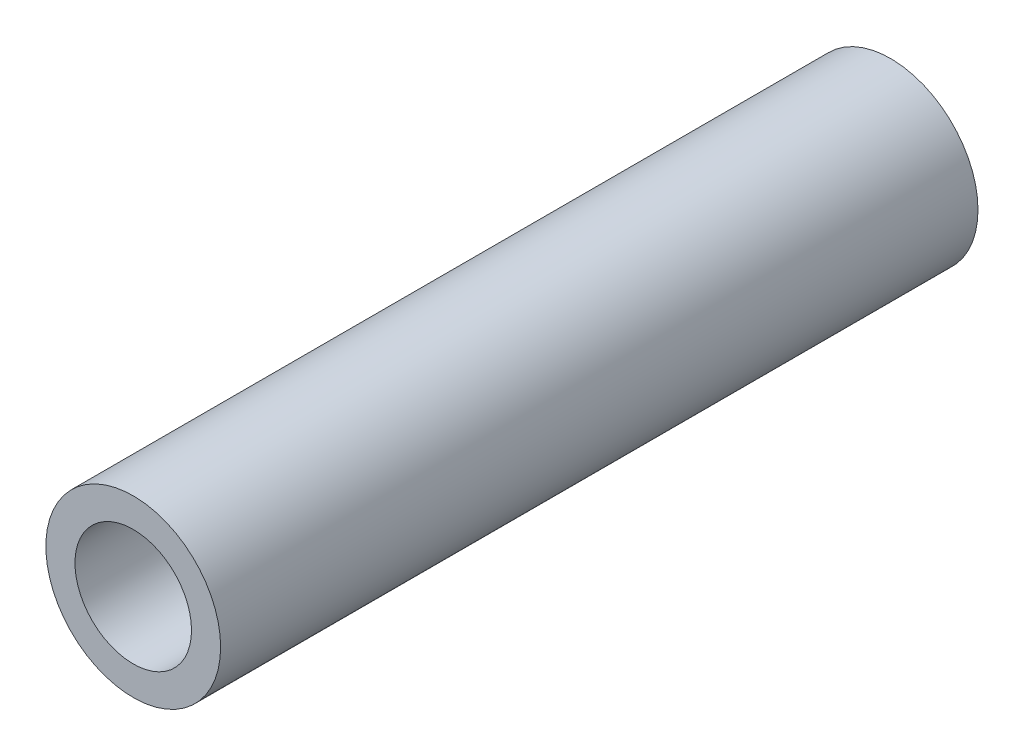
ISO-10303-21;
HEADER;
FILE_DESCRIPTION(('STEP AP214'),'2;1');
FILE_NAME('part.step','',(''),(''),'','','');
FILE_SCHEMA(('AUTOMOTIVE_DESIGN { 1 0 10303 214 1 1 1 1 }'));
ENDSEC;
DATA;
#1=APPLICATION_CONTEXT('core data for automotive mechanical design processes');
#2=APPLICATION_PROTOCOL_DEFINITION('international standard','automotive_design',2000,#1);
#3=PRODUCT_CONTEXT('',#1,'mechanical');
#4=PRODUCT('Part','Part','',(#3));
#5=PRODUCT_RELATED_PRODUCT_CATEGORY('part','',(#4));
#6=PRODUCT_DEFINITION_FORMATION('','',#4);
#7=PRODUCT_DEFINITION_CONTEXT('part definition',#1,'design');
#8=PRODUCT_DEFINITION('design','',#6,#7);
#9=PRODUCT_DEFINITION_SHAPE('','',#8);
#10=(LENGTH_UNIT() NAMED_UNIT(*) SI_UNIT(.MILLI.,.METRE.));
#11=(NAMED_UNIT(*) PLANE_ANGLE_UNIT() SI_UNIT($,.RADIAN.));
#12=(NAMED_UNIT(*) SI_UNIT($,.STERADIAN.) SOLID_ANGLE_UNIT());
#13=UNCERTAINTY_MEASURE_WITH_UNIT(LENGTH_MEASURE(1.E-05),#10,'distance_accuracy_value','');
#14=(GEOMETRIC_REPRESENTATION_CONTEXT(3) GLOBAL_UNCERTAINTY_ASSIGNED_CONTEXT((#13)) GLOBAL_UNIT_ASSIGNED_CONTEXT((#10,
#11,#12)) REPRESENTATION_CONTEXT('',''));
#15=CARTESIAN_POINT('',(0.,0.,0.));
#16=DIRECTION('',(0.,0.,1.));
#17=DIRECTION('',(1.,0.,0.));
#18=AXIS2_PLACEMENT_3D('',#15,#16,#17);
#19=CARTESIAN_POINT('',(0.,0.,26.));
#20=DIRECTION('',(0.,0.,1.));
#21=DIRECTION('',(1.,0.,0.));
#22=AXIS2_PLACEMENT_3D('',#19,#20,#21);
#23=PLANE('',#22);
#24=CARTESIAN_POINT('',(0.,0.,26.));
#25=DIRECTION('',(0.,0.,1.));
#26=DIRECTION('',(1.,0.,0.));
#27=AXIS2_PLACEMENT_3D('',#24,#25,#26);
#28=CIRCLE('',#27,3.);
#29=CARTESIAN_POINT('',(3.,0.,26.));
#30=VERTEX_POINT('',#29);
#31=EDGE_CURVE('E10',#30,#30,#28,.T.);
#32=ORIENTED_EDGE('',*,*,#31,.T.);
#33=EDGE_LOOP('',(#32));
#34=FACE_BOUND('',#33,.T.);
#35=CARTESIAN_POINT('',(0.,0.,26.));
#36=DIRECTION('',(0.,0.,1.));
#37=DIRECTION('',(1.,0.,0.));
#38=AXIS2_PLACEMENT_3D('',#35,#36,#37);
#39=CIRCLE('',#38,2.);
#40=CARTESIAN_POINT('',(2.,0.,26.));
#41=VERTEX_POINT('',#40);
#42=EDGE_CURVE('E35',#41,#41,#39,.T.);
#43=ORIENTED_EDGE('',*,*,#42,.F.);
#44=EDGE_LOOP('',(#43));
#45=FACE_BOUND('',#44,.T.);
#46=ADVANCED_FACE('F24',(#34,#45),#23,.T.);
#47=CARTESIAN_POINT('',(0.,0.,0.));
#48=DIRECTION('',(0.,0.,1.));
#49=DIRECTION('',(1.,0.,0.));
#50=AXIS2_PLACEMENT_3D('',#47,#48,#49);
#51=PLANE('',#50);
#52=CARTESIAN_POINT('',(0.,0.,0.));
#53=DIRECTION('',(0.,0.,1.));
#54=DIRECTION('',(1.,0.,0.));
#55=AXIS2_PLACEMENT_3D('',#52,#53,#54);
#56=CIRCLE('',#55,3.);
#57=CARTESIAN_POINT('',(3.,0.,0.));
#58=VERTEX_POINT('',#57);
#59=EDGE_CURVE('E31',#58,#58,#56,.T.);
#60=ORIENTED_EDGE('',*,*,#59,.F.);
#61=EDGE_LOOP('',(#60));
#62=FACE_BOUND('',#61,.T.);
#63=CARTESIAN_POINT('',(0.,0.,0.));
#64=DIRECTION('',(0.,0.,1.));
#65=DIRECTION('',(1.,0.,0.));
#66=AXIS2_PLACEMENT_3D('',#63,#64,#65);
#67=CIRCLE('',#66,2.);
#68=CARTESIAN_POINT('',(2.,0.,0.));
#69=VERTEX_POINT('',#68);
#70=EDGE_CURVE('E39',#69,#69,#67,.T.);
#71=ORIENTED_EDGE('',*,*,#70,.T.);
#72=EDGE_LOOP('',(#71));
#73=FACE_BOUND('',#72,.T.);
#74=ADVANCED_FACE('F45',(#62,#73),#51,.F.);
#75=CARTESIAN_POINT('',(0.,0.,26.));
#76=DIRECTION('',(0.,0.,-1.));
#77=DIRECTION('',(-1.,0.,0.));
#78=AXIS2_PLACEMENT_3D('',#75,#76,#77);
#79=CYLINDRICAL_SURFACE('',#78,3.);
#80=ORIENTED_EDGE('',*,*,#31,.F.);
#81=EDGE_LOOP('',(#80));
#82=FACE_BOUND('',#81,.T.);
#83=ORIENTED_EDGE('',*,*,#59,.T.);
#84=EDGE_LOOP('',(#83));
#85=FACE_BOUND('',#84,.T.);
#86=ADVANCED_FACE('F26',(#82,#85),#79,.T.);
#87=CARTESIAN_POINT('',(0.,0.,26.));
#88=DIRECTION('',(0.,0.,-1.));
#89=DIRECTION('',(-1.,0.,0.));
#90=AXIS2_PLACEMENT_3D('',#87,#88,#89);
#91=CYLINDRICAL_SURFACE('',#90,2.);
#92=ORIENTED_EDGE('',*,*,#42,.T.);
#93=EDGE_LOOP('',(#92));
#94=FACE_BOUND('',#93,.T.);
#95=ORIENTED_EDGE('',*,*,#70,.F.);
#96=EDGE_LOOP('',(#95));
#97=FACE_BOUND('',#96,.T.);
#98=ADVANCED_FACE('F47',(#94,#97),#91,.F.);
#99=CLOSED_SHELL('',(#46,#74,#86,#98));
#100=MANIFOLD_SOLID_BREP('B2',#99);
#101=ADVANCED_BREP_SHAPE_REPRESENTATION('',(#18,#100),#14);
#102=SHAPE_DEFINITION_REPRESENTATION(#9,#101);
ENDSEC;
END-ISO-10303-21;
